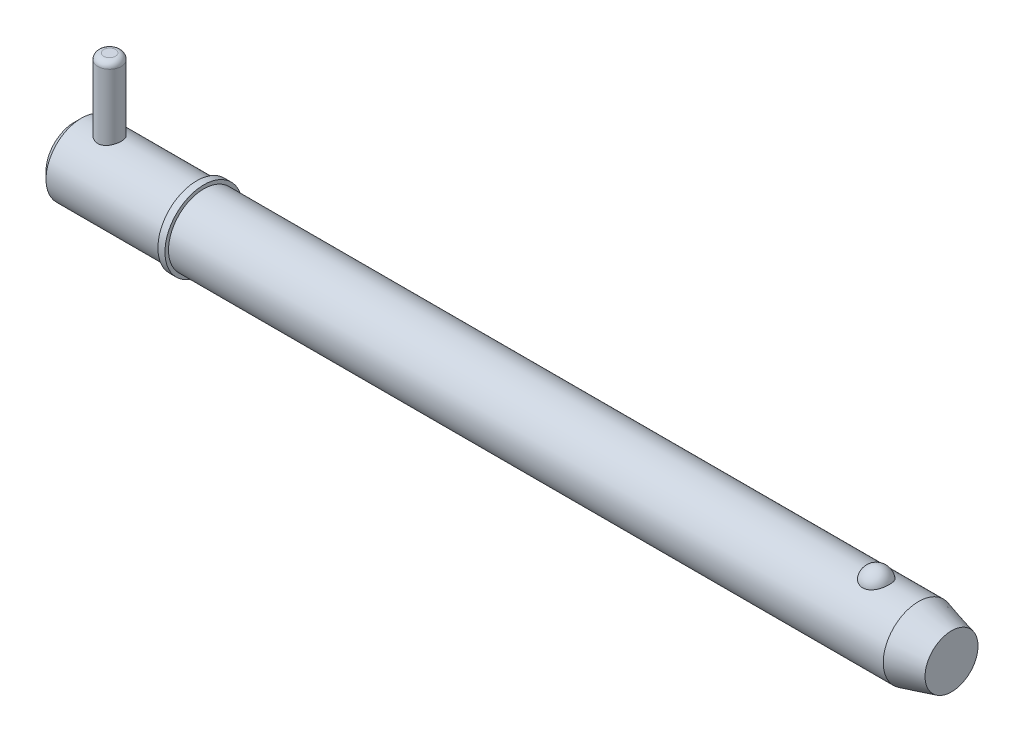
ISO-10303-21;
HEADER;
FILE_DESCRIPTION(('STEP AP214'),'2;1');
FILE_NAME('part.step','',(''),(''),'','','');
FILE_SCHEMA(('AUTOMOTIVE_DESIGN { 1 0 10303 214 1 1 1 1 }'));
ENDSEC;
DATA;
#1=APPLICATION_CONTEXT('core data for automotive mechanical design processes');
#2=APPLICATION_PROTOCOL_DEFINITION('international standard','automotive_design',2000,#1);
#3=PRODUCT_CONTEXT('',#1,'mechanical');
#4=PRODUCT('Part','Part','',(#3));
#5=PRODUCT_RELATED_PRODUCT_CATEGORY('part','',(#4));
#6=PRODUCT_DEFINITION_FORMATION('','',#4);
#7=PRODUCT_DEFINITION_CONTEXT('part definition',#1,'design');
#8=PRODUCT_DEFINITION('design','',#6,#7);
#9=PRODUCT_DEFINITION_SHAPE('','',#8);
#10=(LENGTH_UNIT() NAMED_UNIT(*) SI_UNIT(.MILLI.,.METRE.));
#11=(NAMED_UNIT(*) PLANE_ANGLE_UNIT() SI_UNIT($,.RADIAN.));
#12=(NAMED_UNIT(*) SI_UNIT($,.STERADIAN.) SOLID_ANGLE_UNIT());
#13=UNCERTAINTY_MEASURE_WITH_UNIT(LENGTH_MEASURE(1.E-05),#10,'distance_accuracy_value','');
#14=(GEOMETRIC_REPRESENTATION_CONTEXT(3) GLOBAL_UNCERTAINTY_ASSIGNED_CONTEXT((#13)) GLOBAL_UNIT_ASSIGNED_CONTEXT((#10,
#11,#12)) REPRESENTATION_CONTEXT('',''));
#15=CARTESIAN_POINT('',(0.,0.,0.));
#16=DIRECTION('',(0.,0.,1.));
#17=DIRECTION('',(1.,0.,0.));
#18=AXIS2_PLACEMENT_3D('',#15,#16,#17);
#19=CARTESIAN_POINT('',(9.525,28.575,0.));
#20=DIRECTION('',(0.,-1.,0.));
#21=DIRECTION('',(0.,0.,-1.));
#22=AXIS2_PLACEMENT_3D('',#19,#20,#21);
#23=CYLINDRICAL_SURFACE('',#22,3.175);
#24=CARTESIAN_POINT('',(9.525,-7.93750000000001,0.));
#25=DIRECTION('',(0.,1.,0.));
#26=DIRECTION('',(0.,0.,1.));
#27=AXIS2_PLACEMENT_3D('',#24,#25,#26);
#28=CIRCLE('',#27,3.175);
#29=CARTESIAN_POINT('',(9.525,-7.93750000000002,-3.175));
#30=VERTEX_POINT('',#29);
#31=EDGE_CURVE('P0_E25',#30,#30,#28,.T.);
#32=CARTESIAN_POINT('',(9.525,26.9875,0.));
#33=DIRECTION('',(0.,1.,0.));
#34=DIRECTION('',(0.,0.,1.));
#35=AXIS2_PLACEMENT_3D('',#32,#33,#34);
#36=CIRCLE('',#35,3.175);
#37=CARTESIAN_POINT('',(9.525,26.9875,-3.175));
#38=VERTEX_POINT('',#37);
#39=EDGE_CURVE('P0_E29',#38,#38,#36,.F.);
#40=CARTESIAN_POINT('',(9.525,-7.93750000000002,-3.175));
#41=CARTESIAN_POINT('',(9.525,-7.57369791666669,-3.175));
#42=CARTESIAN_POINT('',(9.525,-7.20989583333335,-3.175));
#43=CARTESIAN_POINT('',(9.525,-6.48229166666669,-3.175));
#44=CARTESIAN_POINT('',(9.525,-6.11848958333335,-3.175));
#45=CARTESIAN_POINT('',(9.525,-5.39088541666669,-3.175));
#46=CARTESIAN_POINT('',(9.525,-5.02708333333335,-3.175));
#47=CARTESIAN_POINT('',(9.525,-4.29947916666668,-3.175));
#48=CARTESIAN_POINT('',(9.525,-3.93567708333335,-3.175));
#49=CARTESIAN_POINT('',(9.525,-3.20807291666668,-3.175));
#50=CARTESIAN_POINT('',(9.525,-2.84427083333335,-3.175));
#51=CARTESIAN_POINT('',(9.525,-2.11666666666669,-3.175));
#52=CARTESIAN_POINT('',(9.525,-1.75286458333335,-3.175));
#53=CARTESIAN_POINT('',(9.525,-1.02526041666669,-3.175));
#54=CARTESIAN_POINT('',(9.525,-0.661458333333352,-3.175));
#55=CARTESIAN_POINT('',(9.525,0.0661458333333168,-3.175));
#56=CARTESIAN_POINT('',(9.525,0.429947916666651,-3.175));
#57=CARTESIAN_POINT('',(9.525,1.15755208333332,-3.175));
#58=CARTESIAN_POINT('',(9.525,1.52135416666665,-3.175));
#59=CARTESIAN_POINT('',(9.525,2.24895833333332,-3.175));
#60=CARTESIAN_POINT('',(9.525,2.61276041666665,-3.175));
#61=CARTESIAN_POINT('',(9.525,3.34036458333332,-3.175));
#62=CARTESIAN_POINT('',(9.525,3.70416666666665,-3.175));
#63=CARTESIAN_POINT('',(9.525,4.43177083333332,-3.175));
#64=CARTESIAN_POINT('',(9.525,4.79557291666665,-3.175));
#65=CARTESIAN_POINT('',(9.525,5.52317708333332,-3.175));
#66=CARTESIAN_POINT('',(9.525,5.88697916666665,-3.175));
#67=CARTESIAN_POINT('',(9.525,6.61458333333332,-3.175));
#68=CARTESIAN_POINT('',(9.525,6.97838541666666,-3.175));
#69=CARTESIAN_POINT('',(9.525,7.70598958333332,-3.175));
#70=CARTESIAN_POINT('',(9.525,8.06979166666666,-3.175));
#71=CARTESIAN_POINT('',(9.525,8.79739583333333,-3.175));
#72=CARTESIAN_POINT('',(9.525,9.16119791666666,-3.175));
#73=CARTESIAN_POINT('',(9.525,9.88880208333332,-3.175));
#74=CARTESIAN_POINT('',(9.525,10.2526041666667,-3.175));
#75=CARTESIAN_POINT('',(9.525,10.9802083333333,-3.175));
#76=CARTESIAN_POINT('',(9.525,11.3440104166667,-3.175));
#77=CARTESIAN_POINT('',(9.525,12.0716145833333,-3.175));
#78=CARTESIAN_POINT('',(9.525,12.4354166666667,-3.175));
#79=CARTESIAN_POINT('',(9.525,13.1630208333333,-3.175));
#80=CARTESIAN_POINT('',(9.525,13.5268229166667,-3.175));
#81=CARTESIAN_POINT('',(9.525,14.2544270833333,-3.175));
#82=CARTESIAN_POINT('',(9.525,14.6182291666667,-3.175));
#83=CARTESIAN_POINT('',(9.525,15.3458333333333,-3.175));
#84=CARTESIAN_POINT('',(9.525,15.7096354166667,-3.175));
#85=CARTESIAN_POINT('',(9.525,16.4372395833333,-3.175));
#86=CARTESIAN_POINT('',(9.525,16.8010416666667,-3.175));
#87=CARTESIAN_POINT('',(9.525,17.5286458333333,-3.175));
#88=CARTESIAN_POINT('',(9.525,17.8924479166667,-3.175));
#89=CARTESIAN_POINT('',(9.525,18.6200520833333,-3.175));
#90=CARTESIAN_POINT('',(9.525,18.9838541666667,-3.175));
#91=CARTESIAN_POINT('',(9.525,19.7114583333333,-3.175));
#92=CARTESIAN_POINT('',(9.525,20.0752604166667,-3.175));
#93=CARTESIAN_POINT('',(9.525,20.8028645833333,-3.175));
#94=CARTESIAN_POINT('',(9.525,21.1666666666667,-3.175));
#95=CARTESIAN_POINT('',(9.525,21.8942708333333,-3.175));
#96=CARTESIAN_POINT('',(9.525,22.2580729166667,-3.175));
#97=CARTESIAN_POINT('',(9.525,22.9856770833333,-3.175));
#98=CARTESIAN_POINT('',(9.525,23.3494791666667,-3.175));
#99=CARTESIAN_POINT('',(9.525,24.0770833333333,-3.175));
#100=CARTESIAN_POINT('',(9.525,24.4408854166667,-3.175));
#101=CARTESIAN_POINT('',(9.525,25.1684895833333,-3.175));
#102=CARTESIAN_POINT('',(9.525,25.5322916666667,-3.175));
#103=CARTESIAN_POINT('',(9.525,26.2598958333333,-3.175));
#104=CARTESIAN_POINT('',(9.525,26.6236979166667,-3.175));
#105=CARTESIAN_POINT('',(9.525,26.9875,-3.175));
#106=B_SPLINE_CURVE_WITH_KNOTS('',3,(#40,#41,#42,#43,#44,#45,#46,#47,#48,#49,#50,#51,#52,#53,
#54,#55,#56,#57,#58,#59,#60,#61,#62,#63,#64,#65,#66,#67,#68,#69,#70,#71,#72,#73,#74,#75,#76,#77,
#78,#79,#80,#81,#82,#83,#84,#85,#86,#87,#88,#89,#90,#91,#92,#93,#94,#95,#96,#97,#98,#99,#100,
#101,#102,#103,#104,#105),.UNSPECIFIED.,.F.,.F.,(4,2,2,2,2,2,2,2,2,2,2,2,2,2,2,2,2,2,2,2,2,2,2,
2,2,2,2,2,2,2,2,2,4),(0.,1.09140625,2.1828125,3.27421875,4.365625,5.45703125,6.5484375,
7.63984375,8.73125000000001,9.82265625,10.9140625,12.00546875,13.096875,14.18828125,15.2796875,
16.37109375,17.4625,18.55390625,19.6453125,20.73671875,21.828125,22.91953125,24.0109375,
25.10234375,26.19375,27.28515625,28.3765625,29.46796875,30.559375,31.65078125,32.7421875,
33.83359375,34.925),.UNSPECIFIED.);
#107=EDGE_CURVE('P0_BSEAM14',#30,#38,#106,.T.);
#108=ORIENTED_EDGE('',*,*,#31,.T.);
#109=ORIENTED_EDGE('',*,*,#39,.T.);
#110=ORIENTED_EDGE('',*,*,#107,.T.);
#111=ORIENTED_EDGE('',*,*,#107,.F.);
#112=EDGE_LOOP('',(#108,#110,#109,#111));
#113=FACE_BOUND('',#112,.T.);
#114=ADVANCED_FACE('P0_F14',(#113),#23,.T.);
#115=CARTESIAN_POINT('',(9.525,28.575,0.));
#116=DIRECTION('',(0.,1.,0.));
#117=DIRECTION('',(0.,0.,1.));
#118=AXIS2_PLACEMENT_3D('',#115,#116,#117);
#119=PLANE('',#118);
#120=CARTESIAN_POINT('',(9.525,28.575,0.));
#121=DIRECTION('',(0.,1.,0.));
#122=DIRECTION('',(0.,0.,1.));
#123=AXIS2_PLACEMENT_3D('',#120,#121,#122);
#124=CIRCLE('',#123,1.5875);
#125=CARTESIAN_POINT('',(9.525,28.575,1.5875));
#126=VERTEX_POINT('',#125);
#127=EDGE_CURVE('P0_E10',#126,#126,#124,.T.);
#128=ORIENTED_EDGE('',*,*,#127,.T.);
#129=EDGE_LOOP('',(#128));
#130=FACE_BOUND('',#129,.T.);
#131=ADVANCED_FACE('P0_F46',(#130),#119,.T.);
#132=CARTESIAN_POINT('',(9.525,-9.525,0.));
#133=DIRECTION('',(0.,1.,0.));
#134=DIRECTION('',(0.,0.,1.));
#135=AXIS2_PLACEMENT_3D('',#132,#133,#134);
#136=PLANE('',#135);
#137=CARTESIAN_POINT('',(9.525,-9.525,0.));
#138=DIRECTION('',(0.,1.,0.));
#139=DIRECTION('',(0.,0.,1.));
#140=AXIS2_PLACEMENT_3D('',#137,#138,#139);
#141=CIRCLE('',#140,1.5875);
#142=CARTESIAN_POINT('',(9.525,-9.525,1.5875));
#143=VERTEX_POINT('',#142);
#144=EDGE_CURVE('P0_E21',#143,#143,#141,.F.);
#145=ORIENTED_EDGE('',*,*,#144,.T.);
#146=EDGE_LOOP('',(#145));
#147=FACE_BOUND('',#146,.T.);
#148=ADVANCED_FACE('P0_F43',(#147),#136,.F.);
#149=CARTESIAN_POINT('',(9.525,-7.9375,0.));
#150=DIRECTION('',(0.,1.,0.));
#151=DIRECTION('',(0.,0.,1.));
#152=AXIS2_PLACEMENT_3D('',#149,#150,#151);
#153=DEGENERATE_TOROIDAL_SURFACE('',#152,1.5875,1.5875,.T.);
#154=ORIENTED_EDGE('',*,*,#144,.F.);
#155=EDGE_LOOP('',(#154));
#156=FACE_BOUND('',#155,.T.);
#157=ORIENTED_EDGE('',*,*,#31,.F.);
#158=EDGE_LOOP('',(#157));
#159=FACE_BOUND('',#158,.T.);
#160=ADVANCED_FACE('P0_F38',(#156,#159),#153,.T.);
#161=CARTESIAN_POINT('',(9.525,26.9875,0.));
#162=DIRECTION('',(0.,1.,0.));
#163=DIRECTION('',(0.,0.,1.));
#164=AXIS2_PLACEMENT_3D('',#161,#162,#163);
#165=DEGENERATE_TOROIDAL_SURFACE('',#164,1.5875,1.5875,.T.);
#166=ORIENTED_EDGE('',*,*,#39,.F.);
#167=EDGE_LOOP('',(#166));
#168=FACE_BOUND('',#167,.T.);
#169=ORIENTED_EDGE('',*,*,#127,.F.);
#170=EDGE_LOOP('',(#169));
#171=FACE_BOUND('',#170,.T.);
#172=ADVANCED_FACE('P0_F16',(#168,#171),#165,.T.);
#173=CLOSED_SHELL('',(#114,#131,#148,#160,#172));
#174=MANIFOLD_SOLID_BREP('P0_B1',#173);
#175=CARTESIAN_POINT('',(0.,0.,0.));
#176=DIRECTION('',(1.,0.,0.));
#177=DIRECTION('',(0.,0.,-1.));
#178=AXIS2_PLACEMENT_3D('',#175,#176,#177);
#179=CYLINDRICAL_SURFACE('',#178,9.525);
#180=CARTESIAN_POINT('',(227.643054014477,0.,0.));
#181=DIRECTION('',(1.,0.,0.));
#182=DIRECTION('',(0.,0.,-1.));
#183=AXIS2_PLACEMENT_3D('',#180,#181,#182);
#184=CIRCLE('',#183,9.525);
#185=CARTESIAN_POINT('',(227.643054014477,0.,-9.525));
#186=VERTEX_POINT('',#185);
#187=EDGE_CURVE('P1_E81',#186,#186,#184,.T.);
#188=ORIENTED_EDGE('',*,*,#187,.F.);
#189=EDGE_LOOP('',(#188));
#190=FACE_BOUND('',#189,.T.);
#191=CARTESIAN_POINT('',(34.93,0.,0.));
#192=DIRECTION('',(1.,0.,0.));
#193=DIRECTION('',(0.,0.,-1.));
#194=AXIS2_PLACEMENT_3D('',#191,#192,#193);
#195=CIRCLE('',#194,9.525);
#196=CARTESIAN_POINT('',(34.93,0.,-9.525));
#197=VERTEX_POINT('',#196);
#198=EDGE_CURVE('P1_E85',#197,#197,#195,.T.);
#199=ORIENTED_EDGE('',*,*,#198,.T.);
#200=EDGE_LOOP('',(#199));
#201=FACE_BOUND('',#200,.T.);
#202=CARTESIAN_POINT('',(216.245757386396,8.80405803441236,3.63513233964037));
#203=CARTESIAN_POINT('',(216.151676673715,8.80405953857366,3.63513053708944));
#204=CARTESIAN_POINT('',(216.057561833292,8.80561325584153,3.63137461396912));
#205=CARTESIAN_POINT('',(215.870012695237,8.81177748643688,3.616386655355));
#206=CARTESIAN_POINT('',(215.776578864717,8.81638992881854,3.60514990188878));
#207=CARTESIAN_POINT('',(215.497945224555,8.83467114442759,3.56024627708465));
#208=CARTESIAN_POINT('',(215.314691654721,8.85278327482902,3.51538626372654));
#209=CARTESIAN_POINT('',(214.959509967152,8.89871214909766,3.39742145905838));
#210=CARTESIAN_POINT('',(214.787553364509,8.9265032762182,3.32439116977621));
#211=CARTESIAN_POINT('',(214.458707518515,8.98874819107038,3.15220244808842));
#212=CARTESIAN_POINT('',(214.301811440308,9.02319893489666,3.053055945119));
#213=CARTESIAN_POINT('',(214.002214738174,9.0962918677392,2.82797815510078));
#214=CARTESIAN_POINT('',(213.860060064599,9.13502685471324,2.70135138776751));
#215=CARTESIAN_POINT('',(213.598299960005,9.21186572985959,2.42641932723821));
#216=CARTESIAN_POINT('',(213.478701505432,9.2499694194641,2.27810735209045));
#217=CARTESIAN_POINT('',(213.259645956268,9.3234108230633,1.95652290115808));
#218=CARTESIAN_POINT('',(213.161317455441,9.35855090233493,1.78243511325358));
#219=CARTESIAN_POINT('',(212.993819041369,9.42045142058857,1.41937246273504));
#220=CARTESIAN_POINT('',(212.924651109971,9.44721128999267,1.23039658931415));
#221=CARTESIAN_POINT('',(212.816199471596,9.48990641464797,0.840370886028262));
#222=CARTESIAN_POINT('',(212.777288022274,9.50570658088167,0.639202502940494));
#223=CARTESIAN_POINT('',(212.731555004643,9.52433146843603,0.232664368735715));
#224=CARTESIAN_POINT('',(212.724732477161,9.52715657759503,0.0272947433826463));
#225=CARTESIAN_POINT('',(212.743255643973,9.51956918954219,-0.380478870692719));
#226=CARTESIAN_POINT('',(212.768405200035,9.50923740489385,-0.582893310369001));
#227=CARTESIAN_POINT('',(212.85002537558,9.47651897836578,-0.980293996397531));
#228=CARTESIAN_POINT('',(212.906496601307,9.45413210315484,-1.17528009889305));
#229=CARTESIAN_POINT('',(213.049719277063,9.39954044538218,-1.55263697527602));
#230=CARTESIAN_POINT('',(213.136512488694,9.36732213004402,-1.73498993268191));
#231=CARTESIAN_POINT('',(213.338610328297,9.29640700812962,-2.08177763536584));
#232=CARTESIAN_POINT('',(213.453917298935,9.25770966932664,-2.24621090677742));
#233=CARTESIAN_POINT('',(213.711264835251,9.17775604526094,-2.5533833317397));
#234=CARTESIAN_POINT('',(213.853434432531,9.136488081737,-2.69601150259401));
#235=CARTESIAN_POINT('',(214.16089985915,9.05620497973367,-2.95451229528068));
#236=CARTESIAN_POINT('',(214.326193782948,9.01718965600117,-3.07038711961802));
#237=CARTESIAN_POINT('',(214.672052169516,8.9468001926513,-3.26976836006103));
#238=CARTESIAN_POINT('',(214.852227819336,8.91528408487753,-3.35389750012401));
#239=CARTESIAN_POINT('',(215.225651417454,8.86272514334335,-3.49043503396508));
#240=CARTESIAN_POINT('',(215.418894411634,8.8416783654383,-3.54285537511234));
#241=CARTESIAN_POINT('',(215.802503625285,8.81348056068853,-3.61241306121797));
#242=CARTESIAN_POINT('',(215.992525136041,8.80568348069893,-3.63119339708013));
#243=CARTESIAN_POINT('',(216.373190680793,8.80289410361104,-3.6379534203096));
#244=CARTESIAN_POINT('',(216.563834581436,8.8078992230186,-3.6259393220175));
#245=CARTESIAN_POINT('',(216.934007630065,8.82974915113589,-3.57238430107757));
#246=CARTESIAN_POINT('',(217.113697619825,8.84621463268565,-3.53178890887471));
#247=CARTESIAN_POINT('',(217.463422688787,8.88875330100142,-3.42331083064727));
#248=CARTESIAN_POINT('',(217.633456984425,8.91482726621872,-3.35542593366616));
#249=CARTESIAN_POINT('',(217.963237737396,8.97448239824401,-3.19248225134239));
#250=CARTESIAN_POINT('',(218.122680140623,9.00821446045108,-3.09686474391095));
#251=CARTESIAN_POINT('',(218.423513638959,9.0793539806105,-2.88162736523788));
#252=CARTESIAN_POINT('',(218.564900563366,9.1167622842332,-2.7620019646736));
#253=CARTESIAN_POINT('',(218.83331931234,9.19347419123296,-2.49516285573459));
#254=CARTESIAN_POINT('',(218.959275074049,9.23277872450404,-2.34686614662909));
#255=CARTESIAN_POINT('',(219.185522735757,9.30737610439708,-2.03093683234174));
#256=CARTESIAN_POINT('',(219.28581004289,9.34266823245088,-1.86330077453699));
#257=CARTESIAN_POINT('',(219.461514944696,9.40674710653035,-1.50744893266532));
#258=CARTESIAN_POINT('',(219.536041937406,9.4352917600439,-1.31874876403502));
#259=CARTESIAN_POINT('',(219.65416505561,9.4814413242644,-0.930631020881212));
#260=CARTESIAN_POINT('',(219.697760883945,9.49904612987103,-0.73121334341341));
#261=CARTESIAN_POINT('',(219.753158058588,9.5215314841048,-0.327147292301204));
#262=CARTESIAN_POINT('',(219.764935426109,9.52640243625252,-0.122495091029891));
#263=CARTESIAN_POINT('',(219.756382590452,9.52289571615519,0.286018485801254));
#264=CARTESIAN_POINT('',(219.73605305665,9.51451832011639,0.489879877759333));
#265=CARTESIAN_POINT('',(219.663884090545,9.48544083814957,0.889994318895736));
#266=CARTESIAN_POINT('',(219.612199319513,9.46480124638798,1.08627971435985));
#267=CARTESIAN_POINT('',(219.478491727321,9.4133389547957,1.46682086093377));
#268=CARTESIAN_POINT('',(219.396466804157,9.38251554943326,1.65107577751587));
#269=CARTESIAN_POINT('',(219.20319292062,9.31365636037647,2.00346348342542));
#270=CARTESIAN_POINT('',(219.091783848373,9.27558138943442,2.17150083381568));
#271=CARTESIAN_POINT('',(218.842294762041,9.19638714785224,2.48563115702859));
#272=CARTESIAN_POINT('',(218.704216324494,9.15526805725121,2.63172542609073));
#273=CARTESIAN_POINT('',(218.404843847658,9.07465393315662,2.89750997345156));
#274=CARTESIAN_POINT('',(218.243610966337,9.03515496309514,3.01726776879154));
#275=CARTESIAN_POINT('',(217.901613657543,8.96227564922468,3.22732920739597));
#276=CARTESIAN_POINT('',(217.720841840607,8.92889763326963,3.31762165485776));
#277=CARTESIAN_POINT('',(217.351445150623,8.87345380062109,3.46314419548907));
#278=CARTESIAN_POINT('',(217.16332371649,8.85102983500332,3.51950082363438));
#279=CARTESIAN_POINT('',(216.87578699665,8.82666967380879,3.57993683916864));
#280=CARTESIAN_POINT('',(216.779133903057,8.82009725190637,3.59606217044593));
#281=CARTESIAN_POINT('',(216.584677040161,8.81020897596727,3.62022512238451));
#282=CARTESIAN_POINT('',(216.48687410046,8.80689090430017,3.62826825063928));
#283=CARTESIAN_POINT('',(216.341224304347,8.80445615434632,3.63416760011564));
#284=CARTESIAN_POINT('',(216.293495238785,8.80405727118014,3.63513325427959));
#285=CARTESIAN_POINT('',(216.245757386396,8.80405803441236,3.63513233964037));
#286=B_SPLINE_CURVE_WITH_KNOTS('',3,(#202,#203,#204,#205,#206,#207,#208,#209,#210,#211,#212,
#213,#214,#215,#216,#217,#218,#219,#220,#221,#222,#223,#224,#225,#226,#227,#228,#229,#230,#231,
#232,#233,#234,#235,#236,#237,#238,#239,#240,#241,#242,#243,#244,#245,#246,#247,#248,#249,#250,
#251,#252,#253,#254,#255,#256,#257,#258,#259,#260,#261,#262,#263,#264,#265,#266,#267,#268,#269,
#270,#271,#272,#273,#274,#275,#276,#277,#278,#279,#280,#281,#282,#283,#284,#285),.UNSPECIFIED.,
.T.,.F.,(4,2,2,2,2,2,2,2,2,2,2,2,2,2,2,2,2,2,2,2,2,2,2,2,2,2,2,2,2,2,2,2,2,2,2,2,2,2,2,2,2,4),
(0.,0.282202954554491,0.564584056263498,1.13017050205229,1.69427128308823,2.25811483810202,
2.83836627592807,3.41879688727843,4.02497117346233,4.63118665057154,5.24474754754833,
5.85829010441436,6.46808687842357,7.07789545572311,7.68854723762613,8.29924920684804,
8.91296283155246,9.52662591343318,10.1275338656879,10.7282152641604,11.2986646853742,
11.868998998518,12.4213015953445,12.9736489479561,13.5380053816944,14.1024919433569,
14.6952986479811,15.2882113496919,15.8999469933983,16.5116885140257,17.1238909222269,
17.7360805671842,18.3452748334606,18.9545113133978,19.5671386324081,20.1797297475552,
20.7907316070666,21.4019653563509,21.9915938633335,22.2859053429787,22.580016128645,
22.7232098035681),.UNSPECIFIED.);
#287=CARTESIAN_POINT('',(216.245757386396,8.80405803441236,3.63513233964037));
#288=VERTEX_POINT('',#287);
#289=EDGE_CURVE('P1_E35',#288,#288,#286,.T.);
#290=ORIENTED_EDGE('',*,*,#289,.T.);
#291=EDGE_LOOP('',(#290));
#292=FACE_BOUND('',#291,.T.);
#293=ADVANCED_FACE('P1_F13',(#190,#201,#292),#179,.T.);
#294=CARTESIAN_POINT('',(0.,0.,0.));
#295=DIRECTION('',(-1.,0.,0.));
#296=DIRECTION('',(0.,0.,1.));
#297=AXIS2_PLACEMENT_3D('',#294,#295,#296);
#298=PLANE('',#297);
#299=CARTESIAN_POINT('',(0.,0.,0.));
#300=DIRECTION('',(1.,0.,0.));
#301=DIRECTION('',(0.,0.,-1.));
#302=AXIS2_PLACEMENT_3D('',#299,#300,#301);
#303=CIRCLE('',#302,7.62);
#304=CARTESIAN_POINT('',(0.,0.,-7.62));
#305=VERTEX_POINT('',#304);
#306=EDGE_CURVE('P1_E9',#305,#305,#303,.T.);
#307=ORIENTED_EDGE('',*,*,#306,.F.);
#308=EDGE_LOOP('',(#307));
#309=FACE_BOUND('',#308,.T.);
#310=ADVANCED_FACE('P1_F15',(#309),#298,.T.);
#311=CARTESIAN_POINT('',(1.90499999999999,0.,0.));
#312=DIRECTION('',(1.,0.,0.));
#313=DIRECTION('',(0.,0.,-1.));
#314=AXIS2_PLACEMENT_3D('',#311,#312,#313);
#315=CONICAL_SURFACE('',#314,9.525,0.785398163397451);
#316=ORIENTED_EDGE('',*,*,#306,.T.);
#317=EDGE_LOOP('',(#316));
#318=FACE_BOUND('',#317,.T.);
#319=CARTESIAN_POINT('',(1.90499999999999,0.,0.));
#320=DIRECTION('',(1.,0.,0.));
#321=DIRECTION('',(0.,0.,-1.));
#322=AXIS2_PLACEMENT_3D('',#319,#320,#321);
#323=CIRCLE('',#322,9.525);
#324=CARTESIAN_POINT('',(1.90499999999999,0.,-9.525));
#325=VERTEX_POINT('',#324);
#326=EDGE_CURVE('P1_E26',#325,#325,#323,.T.);
#327=ORIENTED_EDGE('',*,*,#326,.F.);
#328=EDGE_LOOP('',(#327));
#329=FACE_BOUND('',#328,.T.);
#330=ADVANCED_FACE('P1_F77',(#318,#329),#315,.T.);
#331=CARTESIAN_POINT('',(0.,0.,0.));
#332=DIRECTION('',(1.,0.,0.));
#333=DIRECTION('',(0.,0.,-1.));
#334=AXIS2_PLACEMENT_3D('',#331,#332,#333);
#335=CYLINDRICAL_SURFACE('',#334,9.525);
#336=CARTESIAN_POINT('',(9.525,-8.98025612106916,3.175));
#337=CARTESIAN_POINT('',(9.35206354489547,-8.98025555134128,3.17500081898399));
#338=CARTESIAN_POINT('',(9.17913201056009,-8.98530617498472,3.16082293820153));
#339=CARTESIAN_POINT('',(8.83839221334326,-9.00485797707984,3.10467734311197));
#340=CARTESIAN_POINT('',(8.67058479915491,-9.0193607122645,3.06270505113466));
#341=CARTESIAN_POINT('',(8.34508461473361,-9.05599546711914,2.95260866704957));
#342=CARTESIAN_POINT('',(8.18737272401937,-9.07811252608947,2.88453582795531));
#343=CARTESIAN_POINT('',(7.88555684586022,-9.12746212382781,2.72434567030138));
#344=CARTESIAN_POINT('',(7.74145587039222,-9.1546957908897,2.63222304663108));
#345=CARTESIAN_POINT('',(7.46531411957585,-9.21240503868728,2.42268738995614));
#346=CARTESIAN_POINT('',(7.33388351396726,-9.24296141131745,2.30449228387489));
#347=CARTESIAN_POINT('',(7.09229340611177,-9.30319020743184,2.0478358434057));
#348=CARTESIAN_POINT('',(6.98213731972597,-9.33286248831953,1.90937126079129));
#349=CARTESIAN_POINT('',(6.78345450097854,-9.38891527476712,1.61164431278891));
#350=CARTESIAN_POINT('',(6.69556709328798,-9.41518969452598,1.45193356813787));
#351=CARTESIAN_POINT('',(6.54814671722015,-9.46053437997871,1.11896913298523));
#352=CARTESIAN_POINT('',(6.48860610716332,-9.47960658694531,0.945719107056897));
#353=CARTESIAN_POINT('',(6.40163866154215,-9.50782564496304,0.596991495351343));
#354=CARTESIAN_POINT('',(6.373166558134,-9.5172947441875,0.421801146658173));
#355=CARTESIAN_POINT('',(6.3458207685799,-9.52638456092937,0.068890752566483));
#356=CARTESIAN_POINT('',(6.34693945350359,-9.52600781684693,-0.108828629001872));
#357=CARTESIAN_POINT('',(6.37808050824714,-9.51566675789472,-0.454353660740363));
#358=CARTESIAN_POINT('',(6.4069675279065,-9.50607905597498,-0.622274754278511));
#359=CARTESIAN_POINT('',(6.490947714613,-9.47886621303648,-0.950732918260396));
#360=CARTESIAN_POINT('',(6.54604265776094,-9.46124052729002,-1.11126948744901));
#361=CARTESIAN_POINT('',(6.68153768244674,-9.41945253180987,-1.42288410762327));
#362=CARTESIAN_POINT('',(6.76226085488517,-9.3952073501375,-1.57381010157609));
#363=CARTESIAN_POINT('',(6.94645456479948,-9.34270397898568,-1.86030973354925));
#364=CARTESIAN_POINT('',(7.04993142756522,-9.31444467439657,-1.99587908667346));
#365=CARTESIAN_POINT('',(7.28241619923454,-9.25532159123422,-2.2545702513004));
#366=CARTESIAN_POINT('',(7.4123967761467,-9.22439783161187,-2.37680549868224));
#367=CARTESIAN_POINT('',(7.69127470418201,-9.1645528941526,-2.5980302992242));
#368=CARTESIAN_POINT('',(7.84017496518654,-9.13563202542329,-2.6970162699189));
#369=CARTESIAN_POINT('',(8.15547526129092,-9.08273917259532,-2.87016016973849));
#370=CARTESIAN_POINT('',(8.32209451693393,-9.05884361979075,-2.94394402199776));
#371=CARTESIAN_POINT('',(8.66638917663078,-9.01959241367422,-3.06210713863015));
#372=CARTESIAN_POINT('',(8.84405991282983,-9.00423318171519,-3.10649872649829));
#373=CARTESIAN_POINT('',(9.19682677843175,-8.98460345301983,-3.16281207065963));
#374=CARTESIAN_POINT('',(9.37167742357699,-8.9798639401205,-3.17610837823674));
#375=CARTESIAN_POINT('',(9.72113927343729,-8.9806993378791,-3.17374726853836));
#376=CARTESIAN_POINT('',(9.89575051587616,-8.98627237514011,-3.15809511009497));
#377=CARTESIAN_POINT('',(10.2335233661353,-9.00663737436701,-3.09951644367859));
#378=CARTESIAN_POINT('',(10.3968722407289,-9.02110608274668,-3.05754530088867));
#379=CARTESIAN_POINT('',(10.7141759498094,-9.05727657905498,-2.94866651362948));
#380=CARTESIAN_POINT('',(10.8681291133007,-9.07897964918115,-2.88175444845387));
#381=CARTESIAN_POINT('',(11.1676828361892,-9.12802586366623,-2.72248103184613));
#382=CARTESIAN_POINT('',(11.3128635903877,-9.1555260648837,-2.62937980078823));
#383=CARTESIAN_POINT('',(11.5860387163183,-9.21276315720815,-2.42120937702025));
#384=CARTESIAN_POINT('',(11.7140280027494,-9.24250070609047,-2.30613370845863));
#385=CARTESIAN_POINT('',(11.9555513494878,-9.30259247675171,-2.05070616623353));
#386=CARTESIAN_POINT('',(12.0680936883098,-9.33290753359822,-1.90940458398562));
#387=CARTESIAN_POINT('',(12.267933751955,-9.3893275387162,-1.60917665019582));
#388=CARTESIAN_POINT('',(12.3552323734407,-9.41543263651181,-1.45025092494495));
#389=CARTESIAN_POINT('',(12.5013088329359,-9.46036988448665,-1.12007606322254));
#390=CARTESIAN_POINT('',(12.5602723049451,-9.47924920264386,-0.9489158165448));
#391=CARTESIAN_POINT('',(12.6483355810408,-9.50781089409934,-0.598355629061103));
#392=CARTESIAN_POINT('',(12.6774461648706,-9.5174965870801,-0.4189586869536));
#393=CARTESIAN_POINT('',(12.7040070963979,-9.52632915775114,-0.066088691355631));
#394=CARTESIAN_POINT('',(12.7028811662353,-9.52594996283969,0.107266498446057));
#395=CARTESIAN_POINT('',(12.6725130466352,-9.51586223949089,0.451202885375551));
#396=CARTESIAN_POINT('',(12.643273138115,-9.50615446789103,0.621784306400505));
#397=CARTESIAN_POINT('',(12.5584514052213,-9.47867404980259,0.952633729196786));
#398=CARTESIAN_POINT('',(12.5032953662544,-9.46103195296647,1.1130225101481));
#399=CARTESIAN_POINT('',(12.3686013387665,-9.41949985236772,1.42233126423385));
#400=CARTESIAN_POINT('',(12.2890589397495,-9.39560871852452,1.57124915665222));
#401=CARTESIAN_POINT('',(12.1044667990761,-9.34294133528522,1.85938800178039));
#402=CARTESIAN_POINT('',(11.9985831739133,-9.31401720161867,1.9980473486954));
#403=CARTESIAN_POINT('',(11.7657327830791,-9.25490239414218,2.25609475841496));
#404=CARTESIAN_POINT('',(11.6387592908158,-9.22471131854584,2.37547664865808));
#405=CARTESIAN_POINT('',(11.3613902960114,-9.16505913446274,2.59633024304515));
#406=CARTESIAN_POINT('',(11.2102725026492,-9.13567286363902,2.69691791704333));
#407=CARTESIAN_POINT('',(10.8923631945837,-9.08241113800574,2.87119803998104));
#408=CARTESIAN_POINT('',(10.7255757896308,-9.05853424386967,2.94489751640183));
#409=CARTESIAN_POINT('',(10.3887212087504,-9.02021736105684,3.06020415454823));
#410=CARTESIAN_POINT('',(10.219143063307,-9.00539959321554,3.10311136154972));
#411=CARTESIAN_POINT('',(9.87470703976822,-8.98542092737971,3.16050396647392));
#412=CARTESIAN_POINT('',(9.699851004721,-8.98025669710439,3.17499917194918));
#413=CARTESIAN_POINT('',(9.525,-8.98025612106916,3.175));
#414=B_SPLINE_CURVE_WITH_KNOTS('',3,(#336,#337,#338,#339,#340,#341,#342,#343,#344,#345,#346,
#347,#348,#349,#350,#351,#352,#353,#354,#355,#356,#357,#358,#359,#360,#361,#362,#363,#364,#365,
#366,#367,#368,#369,#370,#371,#372,#373,#374,#375,#376,#377,#378,#379,#380,#381,#382,#383,#384,
#385,#386,#387,#388,#389,#390,#391,#392,#393,#394,#395,#396,#397,#398,#399,#400,#401,#402,#403,
#404,#405,#406,#407,#408,#409,#410,#411,#412,#413),.UNSPECIFIED.,.T.,.F.,(4,2,2,2,2,2,2,2,2,2,2,
2,2,2,2,2,2,2,2,2,2,2,2,2,2,2,2,2,2,2,2,2,2,2,2,2,2,2,4),(0.,0.518161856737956,1.03640907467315,
1.55364379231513,2.07099270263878,2.60671746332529,3.14252816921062,3.69231882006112,
4.24196117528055,4.77247962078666,5.30286129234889,5.81244090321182,6.32205505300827,
6.83836754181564,7.3548237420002,7.89559553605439,8.43645060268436,8.98501631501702,
9.53335188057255,10.056948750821,10.5804505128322,11.0859695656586,11.5915782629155,
12.1132237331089,12.6350231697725,13.1819271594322,13.7288117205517,14.2720628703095,
14.815117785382,15.3326491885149,15.8501386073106,16.3594083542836,16.868770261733,
17.3969527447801,17.925304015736,18.4743376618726,19.023227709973,19.5473069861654,
20.0712053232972),.UNSPECIFIED.);
#415=CARTESIAN_POINT('',(9.525,-8.98025612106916,3.175));
#416=VERTEX_POINT('',#415);
#417=EDGE_CURVE('P1_E17',#416,#416,#414,.T.);
#418=ORIENTED_EDGE('',*,*,#417,.F.);
#419=EDGE_LOOP('',(#418));
#420=FACE_BOUND('',#419,.T.);
#421=CARTESIAN_POINT('',(9.525,8.98025612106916,3.175));
#422=CARTESIAN_POINT('',(9.69793645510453,8.98025555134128,3.17500081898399));
#423=CARTESIAN_POINT('',(9.87086798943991,8.98530617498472,3.16082293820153));
#424=CARTESIAN_POINT('',(10.2116077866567,9.00485797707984,3.10467734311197));
#425=CARTESIAN_POINT('',(10.3794152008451,9.0193607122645,3.06270505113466));
#426=CARTESIAN_POINT('',(10.7049153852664,9.05599546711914,2.95260866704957));
#427=CARTESIAN_POINT('',(10.8626272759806,9.07811252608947,2.88453582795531));
#428=CARTESIAN_POINT('',(11.1644431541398,9.12746212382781,2.72434567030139));
#429=CARTESIAN_POINT('',(11.3085441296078,9.15469579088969,2.63222304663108));
#430=CARTESIAN_POINT('',(11.5846858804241,9.21240503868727,2.42268738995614));
#431=CARTESIAN_POINT('',(11.7161164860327,9.24296141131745,2.30449228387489));
#432=CARTESIAN_POINT('',(11.9577065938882,9.30319020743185,2.0478358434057));
#433=CARTESIAN_POINT('',(12.067862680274,9.33286248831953,1.90937126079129));
#434=CARTESIAN_POINT('',(12.2665454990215,9.38891527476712,1.61164431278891));
#435=CARTESIAN_POINT('',(12.354432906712,9.41518969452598,1.45193356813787));
#436=CARTESIAN_POINT('',(12.5018532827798,9.46053437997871,1.11896913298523));
#437=CARTESIAN_POINT('',(12.5613938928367,9.47960658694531,0.945719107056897));
#438=CARTESIAN_POINT('',(12.6483613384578,9.50782564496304,0.596991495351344));
#439=CARTESIAN_POINT('',(12.676833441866,9.5172947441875,0.421801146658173));
#440=CARTESIAN_POINT('',(12.7041792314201,9.52638456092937,0.0688907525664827));
#441=CARTESIAN_POINT('',(12.7030605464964,9.52600781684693,-0.108828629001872));
#442=CARTESIAN_POINT('',(12.6719194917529,9.51566675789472,-0.454353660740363));
#443=CARTESIAN_POINT('',(12.6430324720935,9.50607905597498,-0.622274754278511));
#444=CARTESIAN_POINT('',(12.559052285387,9.47886621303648,-0.950732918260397));
#445=CARTESIAN_POINT('',(12.5039573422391,9.46124052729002,-1.11126948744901));
#446=CARTESIAN_POINT('',(12.3684623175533,9.41945253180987,-1.42288410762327));
#447=CARTESIAN_POINT('',(12.2877391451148,9.3952073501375,-1.57381010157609));
#448=CARTESIAN_POINT('',(12.1035454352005,9.34270397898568,-1.86030973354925));
#449=CARTESIAN_POINT('',(12.0000685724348,9.31444467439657,-1.99587908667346));
#450=CARTESIAN_POINT('',(11.7675838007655,9.25532159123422,-2.2545702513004));
#451=CARTESIAN_POINT('',(11.6376032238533,9.22439783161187,-2.37680549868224));
#452=CARTESIAN_POINT('',(11.358725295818,9.1645528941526,-2.5980302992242));
#453=CARTESIAN_POINT('',(11.2098250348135,9.13563202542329,-2.6970162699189));
#454=CARTESIAN_POINT('',(10.8945247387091,9.08273917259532,-2.87016016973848));
#455=CARTESIAN_POINT('',(10.7279054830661,9.05884361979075,-2.94394402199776));
#456=CARTESIAN_POINT('',(10.3836108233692,9.01959241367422,-3.06210713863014));
#457=CARTESIAN_POINT('',(10.2059400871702,9.00423318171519,-3.10649872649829));
#458=CARTESIAN_POINT('',(9.85317322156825,8.98460345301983,-3.16281207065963));
#459=CARTESIAN_POINT('',(9.67832257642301,8.9798639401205,-3.17610837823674));
#460=CARTESIAN_POINT('',(9.32886072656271,8.9806993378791,-3.17374726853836));
#461=CARTESIAN_POINT('',(9.15424948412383,8.98627237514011,-3.15809511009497));
#462=CARTESIAN_POINT('',(8.81647663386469,9.00663737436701,-3.09951644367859));
#463=CARTESIAN_POINT('',(8.65312775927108,9.02110608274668,-3.05754530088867));
#464=CARTESIAN_POINT('',(8.33582405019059,9.05727657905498,-2.94866651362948));
#465=CARTESIAN_POINT('',(8.18187088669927,9.07897964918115,-2.88175444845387));
#466=CARTESIAN_POINT('',(7.88231716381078,9.12802586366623,-2.72248103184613));
#467=CARTESIAN_POINT('',(7.73713640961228,9.1555260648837,-2.62937980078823));
#468=CARTESIAN_POINT('',(7.46396128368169,9.21276315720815,-2.42120937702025));
#469=CARTESIAN_POINT('',(7.33597199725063,9.24250070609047,-2.30613370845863));
#470=CARTESIAN_POINT('',(7.09444865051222,9.30259247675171,-2.05070616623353));
#471=CARTESIAN_POINT('',(6.98190631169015,9.33290753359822,-1.90940458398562));
#472=CARTESIAN_POINT('',(6.78206624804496,9.3893275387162,-1.60917665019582));
#473=CARTESIAN_POINT('',(6.6947676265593,9.41543263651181,-1.45025092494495));
#474=CARTESIAN_POINT('',(6.54869116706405,9.46036988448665,-1.12007606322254));
#475=CARTESIAN_POINT('',(6.48972769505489,9.47924920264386,-0.948915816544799));
#476=CARTESIAN_POINT('',(6.40166441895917,9.50781089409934,-0.598355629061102));
#477=CARTESIAN_POINT('',(6.3725538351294,9.5174965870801,-0.418958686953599));
#478=CARTESIAN_POINT('',(6.34599290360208,9.52632915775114,-0.0660886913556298));
#479=CARTESIAN_POINT('',(6.3471188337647,9.52594996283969,0.107266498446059));
#480=CARTESIAN_POINT('',(6.37748695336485,9.51586223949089,0.451202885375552));
#481=CARTESIAN_POINT('',(6.40672686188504,9.50615446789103,0.621784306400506));
#482=CARTESIAN_POINT('',(6.49154859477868,9.47867404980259,0.952633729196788));
#483=CARTESIAN_POINT('',(6.54670463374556,9.46103195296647,1.11302251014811));
#484=CARTESIAN_POINT('',(6.68139866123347,9.41949985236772,1.42233126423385));
#485=CARTESIAN_POINT('',(6.76094106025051,9.39560871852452,1.57124915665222));
#486=CARTESIAN_POINT('',(6.94553320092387,9.34294133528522,1.85938800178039));
#487=CARTESIAN_POINT('',(7.05141682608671,9.31401720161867,1.9980473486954));
#488=CARTESIAN_POINT('',(7.28426721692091,9.25490239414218,2.25609475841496));
#489=CARTESIAN_POINT('',(7.41124070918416,9.22471131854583,2.37547664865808));
#490=CARTESIAN_POINT('',(7.68860970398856,9.16505913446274,2.59633024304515));
#491=CARTESIAN_POINT('',(7.83972749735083,9.13567286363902,2.69691791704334));
#492=CARTESIAN_POINT('',(8.15763680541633,9.08241113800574,2.87119803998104));
#493=CARTESIAN_POINT('',(8.32442421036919,9.05853424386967,2.94489751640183));
#494=CARTESIAN_POINT('',(8.66127879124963,9.02021736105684,3.06020415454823));
#495=CARTESIAN_POINT('',(8.83085693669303,9.00539959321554,3.10311136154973));
#496=CARTESIAN_POINT('',(9.17529296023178,8.98542092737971,3.16050396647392));
#497=CARTESIAN_POINT('',(9.350148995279,8.98025669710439,3.17499917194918));
#498=CARTESIAN_POINT('',(9.525,8.98025612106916,3.175));
#499=B_SPLINE_CURVE_WITH_KNOTS('',3,(#421,#422,#423,#424,#425,#426,#427,#428,#429,#430,#431,
#432,#433,#434,#435,#436,#437,#438,#439,#440,#441,#442,#443,#444,#445,#446,#447,#448,#449,#450,
#451,#452,#453,#454,#455,#456,#457,#458,#459,#460,#461,#462,#463,#464,#465,#466,#467,#468,#469,
#470,#471,#472,#473,#474,#475,#476,#477,#478,#479,#480,#481,#482,#483,#484,#485,#486,#487,#488,
#489,#490,#491,#492,#493,#494,#495,#496,#497,#498),.UNSPECIFIED.,.T.,.F.,(4,2,2,2,2,2,2,2,2,2,2,
2,2,2,2,2,2,2,2,2,2,2,2,2,2,2,2,2,2,2,2,2,2,2,2,2,2,2,4),(0.,0.518161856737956,1.03640907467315,
1.55364379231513,2.07099270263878,2.60671746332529,3.14252816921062,3.69231882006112,
4.24196117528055,4.77247962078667,5.30286129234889,5.81244090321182,6.32205505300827,
6.83836754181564,7.3548237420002,7.89559553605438,8.43645060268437,8.98501631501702,
9.53335188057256,10.056948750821,10.5804505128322,11.0859695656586,11.5915782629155,
12.1132237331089,12.6350231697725,13.1819271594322,13.7288117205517,14.2720628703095,
14.815117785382,15.3326491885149,15.8501386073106,16.3594083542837,16.868770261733,
17.3969527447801,17.9253040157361,18.4743376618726,19.023227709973,19.5473069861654,
20.0712053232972),.UNSPECIFIED.);
#500=CARTESIAN_POINT('',(9.525,8.98025612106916,3.175));
#501=VERTEX_POINT('',#500);
#502=EDGE_CURVE('P1_E43',#501,#501,#499,.T.);
#503=ORIENTED_EDGE('',*,*,#502,.F.);
#504=EDGE_LOOP('',(#503));
#505=FACE_BOUND('',#504,.T.);
#506=ORIENTED_EDGE('',*,*,#326,.T.);
#507=EDGE_LOOP('',(#506));
#508=FACE_BOUND('',#507,.T.);
#509=CARTESIAN_POINT('',(33.025,0.,0.));
#510=DIRECTION('',(1.,0.,0.));
#511=DIRECTION('',(0.,0.,-1.));
#512=AXIS2_PLACEMENT_3D('',#509,#510,#511);
#513=CIRCLE('',#512,9.525);
#514=CARTESIAN_POINT('',(33.025,0.,-9.525));
#515=VERTEX_POINT('',#514);
#516=EDGE_CURVE('P1_E31',#515,#515,#513,.T.);
#517=ORIENTED_EDGE('',*,*,#516,.F.);
#518=EDGE_LOOP('',(#517));
#519=FACE_BOUND('',#518,.T.);
#520=ADVANCED_FACE('P1_F103',(#420,#505,#508,#519),#335,.T.);
#521=CARTESIAN_POINT('',(33.025,9.525,0.));
#522=DIRECTION('',(-1.,0.,0.));
#523=DIRECTION('',(0.,0.,1.));
#524=AXIS2_PLACEMENT_3D('',#521,#522,#523);
#525=PLANE('',#524);
#526=ORIENTED_EDGE('',*,*,#516,.T.);
#527=EDGE_LOOP('',(#526));
#528=FACE_BOUND('',#527,.T.);
#529=CARTESIAN_POINT('',(33.025,0.,0.));
#530=DIRECTION('',(1.,0.,0.));
#531=DIRECTION('',(0.,0.,-1.));
#532=AXIS2_PLACEMENT_3D('',#529,#530,#531);
#533=CIRCLE('',#532,10.4775);
#534=CARTESIAN_POINT('',(33.025,0.,-10.4775));
#535=VERTEX_POINT('',#534);
#536=EDGE_CURVE('P1_E91',#535,#535,#533,.T.);
#537=ORIENTED_EDGE('',*,*,#536,.F.);
#538=EDGE_LOOP('',(#537));
#539=FACE_BOUND('',#538,.T.);
#540=ADVANCED_FACE('P1_F100',(#528,#539),#525,.T.);
#541=CARTESIAN_POINT('',(0.,0.,0.));
#542=DIRECTION('',(1.,0.,0.));
#543=DIRECTION('',(0.,0.,-1.));
#544=AXIS2_PLACEMENT_3D('',#541,#542,#543);
#545=CYLINDRICAL_SURFACE('',#544,10.4775);
#546=ORIENTED_EDGE('',*,*,#536,.T.);
#547=EDGE_LOOP('',(#546));
#548=FACE_BOUND('',#547,.T.);
#549=CARTESIAN_POINT('',(34.93,0.,0.));
#550=DIRECTION('',(1.,0.,0.));
#551=DIRECTION('',(0.,0.,-1.));
#552=AXIS2_PLACEMENT_3D('',#549,#550,#551);
#553=CIRCLE('',#552,10.4775);
#554=CARTESIAN_POINT('',(34.93,0.,-10.4775));
#555=VERTEX_POINT('',#554);
#556=EDGE_CURVE('P1_E88',#555,#555,#553,.T.);
#557=ORIENTED_EDGE('',*,*,#556,.F.);
#558=EDGE_LOOP('',(#557));
#559=FACE_BOUND('',#558,.T.);
#560=ADVANCED_FACE('P1_F68',(#548,#559),#545,.T.);
#561=CARTESIAN_POINT('',(34.93,10.4775,0.));
#562=DIRECTION('',(1.,0.,0.));
#563=DIRECTION('',(0.,0.,-1.));
#564=AXIS2_PLACEMENT_3D('',#561,#562,#563);
#565=PLANE('',#564);
#566=ORIENTED_EDGE('',*,*,#556,.T.);
#567=EDGE_LOOP('',(#566));
#568=FACE_BOUND('',#567,.T.);
#569=ORIENTED_EDGE('',*,*,#198,.F.);
#570=EDGE_LOOP('',(#569));
#571=FACE_BOUND('',#570,.T.);
#572=ADVANCED_FACE('P1_F62',(#568,#571),#565,.T.);
#573=CARTESIAN_POINT('',(236.53,0.,0.));
#574=DIRECTION('',(-1.,0.,0.));
#575=DIRECTION('',(0.,0.,1.));
#576=AXIS2_PLACEMENT_3D('',#573,#574,#575);
#577=CONICAL_SURFACE('',#576,7.14375000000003,0.26179938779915);
#578=ORIENTED_EDGE('',*,*,#187,.T.);
#579=EDGE_LOOP('',(#578));
#580=FACE_BOUND('',#579,.T.);
#581=CARTESIAN_POINT('',(236.53,0.,0.));
#582=DIRECTION('',(1.,0.,0.));
#583=DIRECTION('',(0.,0.,-1.));
#584=AXIS2_PLACEMENT_3D('',#581,#582,#583);
#585=CIRCLE('',#584,7.14375000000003);
#586=CARTESIAN_POINT('',(236.53,0.,-7.14375000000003));
#587=VERTEX_POINT('',#586);
#588=EDGE_CURVE('P1_E42',#587,#587,#585,.T.);
#589=ORIENTED_EDGE('',*,*,#588,.F.);
#590=EDGE_LOOP('',(#589));
#591=FACE_BOUND('',#590,.T.);
#592=ADVANCED_FACE('P1_F59',(#580,#591),#577,.T.);
#593=CARTESIAN_POINT('',(236.53,7.14375000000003,0.));
#594=DIRECTION('',(1.,0.,0.));
#595=DIRECTION('',(0.,0.,-1.));
#596=AXIS2_PLACEMENT_3D('',#593,#594,#595);
#597=PLANE('',#596);
#598=ORIENTED_EDGE('',*,*,#588,.T.);
#599=EDGE_LOOP('',(#598));
#600=FACE_BOUND('',#599,.T.);
#601=ADVANCED_FACE('P1_F55',(#600),#597,.T.);
#602=CARTESIAN_POINT('',(216.245757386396,8.5725,0.));
#603=DIRECTION('',(-1.,0.,0.));
#604=DIRECTION('',(0.,1.,0.));
#605=AXIS2_PLACEMENT_3D('',#602,#603,#604);
#606=SPHERICAL_SURFACE('',#605,3.64250000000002);
#607=ORIENTED_EDGE('',*,*,#289,.F.);
#608=EDGE_LOOP('',(#607));
#609=FACE_BOUND('',#608,.T.);
#610=ADVANCED_FACE('P1_F50',(#609),#606,.T.);
#611=CARTESIAN_POINT('',(9.525,-10.4775,0.));
#612=DIRECTION('',(0.,1.,0.));
#613=DIRECTION('',(0.,0.,1.));
#614=AXIS2_PLACEMENT_3D('',#611,#612,#613);
#615=CYLINDRICAL_SURFACE('',#614,3.175);
#616=ORIENTED_EDGE('',*,*,#417,.T.);
#617=EDGE_LOOP('',(#616));
#618=FACE_BOUND('',#617,.T.);
#619=ORIENTED_EDGE('',*,*,#502,.T.);
#620=EDGE_LOOP('',(#619));
#621=FACE_BOUND('',#620,.T.);
#622=ADVANCED_FACE('P1_F54',(#618,#621),#615,.F.);
#623=CLOSED_SHELL('',(#293,#310,#330,#520,#540,#560,#572,#592,#601,#610,#622));
#624=MANIFOLD_SOLID_BREP('P1_B1',#623);
#625=ADVANCED_BREP_SHAPE_REPRESENTATION('',(#18,#174,#624),#14);
#626=SHAPE_DEFINITION_REPRESENTATION(#9,#625);
ENDSEC;
END-ISO-10303-21;
